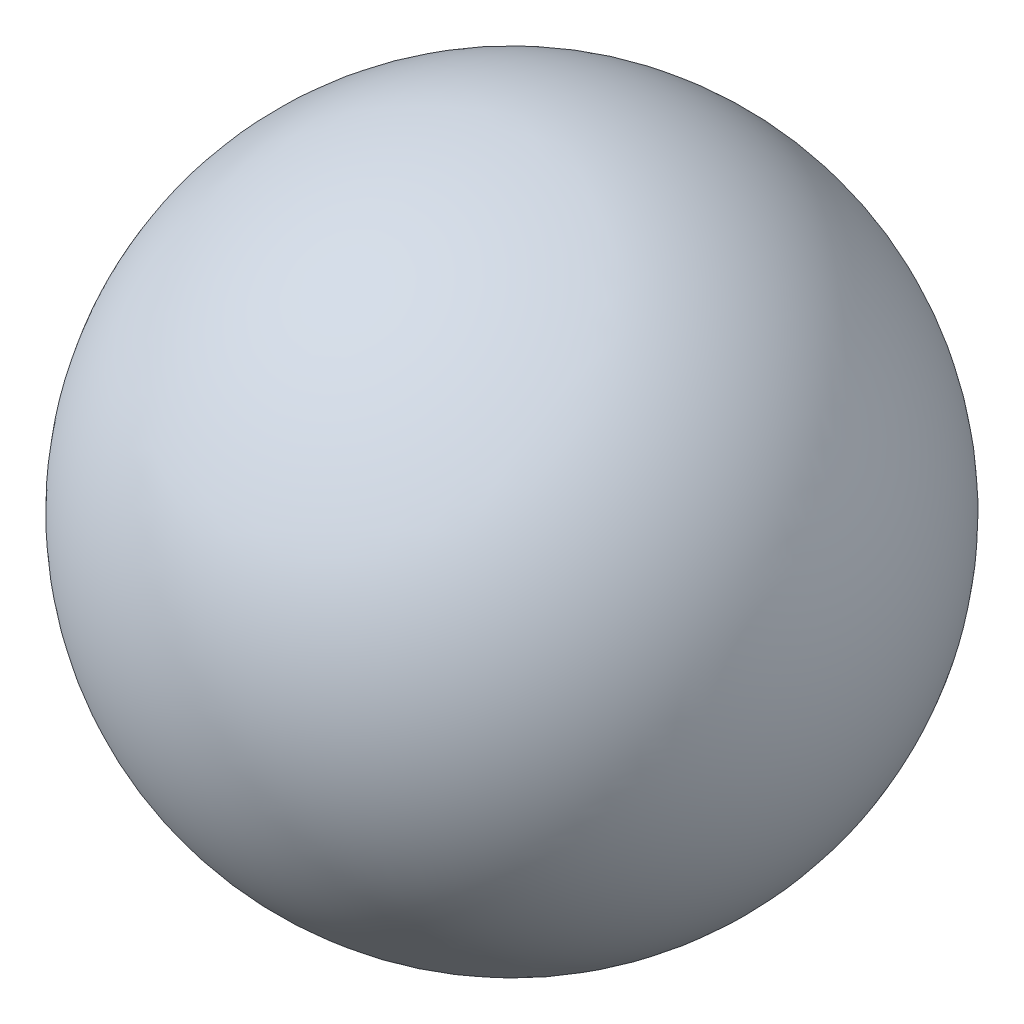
ISO-10303-21;
HEADER;
FILE_DESCRIPTION(('STEP AP214'),'2;1');
FILE_NAME('part.step','',(''),(''),'','','');
FILE_SCHEMA(('AUTOMOTIVE_DESIGN { 1 0 10303 214 1 1 1 1 }'));
ENDSEC;
DATA;
#1=APPLICATION_CONTEXT('core data for automotive mechanical design processes');
#2=APPLICATION_PROTOCOL_DEFINITION('international standard','automotive_design',2000,#1);
#3=PRODUCT_CONTEXT('',#1,'mechanical');
#4=PRODUCT('Part','Part','',(#3));
#5=PRODUCT_RELATED_PRODUCT_CATEGORY('part','',(#4));
#6=PRODUCT_DEFINITION_FORMATION('','',#4);
#7=PRODUCT_DEFINITION_CONTEXT('part definition',#1,'design');
#8=PRODUCT_DEFINITION('design','',#6,#7);
#9=PRODUCT_DEFINITION_SHAPE('','',#8);
#10=(LENGTH_UNIT() NAMED_UNIT(*) SI_UNIT(.MILLI.,.METRE.));
#11=(NAMED_UNIT(*) PLANE_ANGLE_UNIT() SI_UNIT($,.RADIAN.));
#12=(NAMED_UNIT(*) SI_UNIT($,.STERADIAN.) SOLID_ANGLE_UNIT());
#13=UNCERTAINTY_MEASURE_WITH_UNIT(LENGTH_MEASURE(1.E-05),#10,'distance_accuracy_value','');
#14=(GEOMETRIC_REPRESENTATION_CONTEXT(3) GLOBAL_UNCERTAINTY_ASSIGNED_CONTEXT((#13)) GLOBAL_UNIT_ASSIGNED_CONTEXT((#10,
#11,#12)) REPRESENTATION_CONTEXT('',''));
#15=CARTESIAN_POINT('',(0.,0.,0.));
#16=DIRECTION('',(0.,0.,1.));
#17=DIRECTION('',(1.,0.,0.));
#18=AXIS2_PLACEMENT_3D('',#15,#16,#17);
#19=CARTESIAN_POINT('',(0.,0.,0.));
#20=DIRECTION('',(0.,0.,-1.));
#21=DIRECTION('',(0.,-1.,0.));
#22=AXIS2_PLACEMENT_3D('',#19,#20,#21);
#23=SPHERICAL_SURFACE('',#22,15.);
#24=CARTESIAN_POINT('',(0.,0.,0.));
#25=DIRECTION('',(1.,0.,0.));
#26=DIRECTION('',(0.,0.,-1.));
#27=AXIS2_PLACEMENT_3D('',#24,#25,#26);
#28=SPHERICAL_SURFACE('',#27,15.);
#29=CARTESIAN_POINT('',(-12.9903810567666,0.,0.));
#30=DIRECTION('',(1.,0.,0.));
#31=DIRECTION('',(0.,0.,-1.));
#32=AXIS2_PLACEMENT_3D('',#29,#30,#31);
#33=CIRCLE('',#32,7.5);
#34=CARTESIAN_POINT('',(-12.9903810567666,0.,-7.5));
#35=VERTEX_POINT('',#34);
#36=EDGE_CURVE('E10',#35,#35,#33,.F.);
#37=ORIENTED_EDGE('',*,*,#36,.F.);
#38=EDGE_LOOP('',(#37));
#39=FACE_BOUND('',#38,.T.);
#40=ADVANCED_FACE('F35',(#39),#28,.T.);
#41=CARTESIAN_POINT('',(-15.,0.,0.));
#42=DIRECTION('',(1.,0.,0.));
#43=DIRECTION('',(0.,0.,-1.));
#44=AXIS2_PLACEMENT_3D('',#41,#42,#43);
#45=CYLINDRICAL_SURFACE('',#44,7.5);
#46=ORIENTED_EDGE('',*,*,#36,.T.);
#47=EDGE_LOOP('',(#46));
#48=FACE_BOUND('',#47,.T.);
#49=CARTESIAN_POINT('',(0.,0.,0.));
#50=DIRECTION('',(1.,0.,0.));
#51=DIRECTION('',(0.,0.,-1.));
#52=AXIS2_PLACEMENT_3D('',#49,#50,#51);
#53=CIRCLE('',#52,7.5);
#54=CARTESIAN_POINT('',(0.,0.,-7.5));
#55=VERTEX_POINT('',#54);
#56=EDGE_CURVE('E41',#55,#55,#53,.T.);
#57=ORIENTED_EDGE('',*,*,#56,.T.);
#58=EDGE_LOOP('',(#57));
#59=FACE_BOUND('',#58,.T.);
#60=ADVANCED_FACE('F47',(#48,#59),#45,.F.);
#61=CARTESIAN_POINT('',(0.,0.,0.));
#62=DIRECTION('',(1.,0.,0.));
#63=DIRECTION('',(0.,0.,-1.));
#64=AXIS2_PLACEMENT_3D('',#61,#62,#63);
#65=PLANE('',#64);
#66=ORIENTED_EDGE('',*,*,#56,.F.);
#67=EDGE_LOOP('',(#66));
#68=FACE_BOUND('',#67,.T.);
#69=ADVANCED_FACE('F49',(#68),#65,.F.);
#70=CLOSED_SHELL('',(#40,#60,#69));
#71=MANIFOLD_SOLID_BREP('B2',#70);
#72=ADVANCED_BREP_SHAPE_REPRESENTATION('',(#18,#71),#14);
#73=SHAPE_DEFINITION_REPRESENTATION(#9,#72);
ENDSEC;
END-ISO-10303-21;
